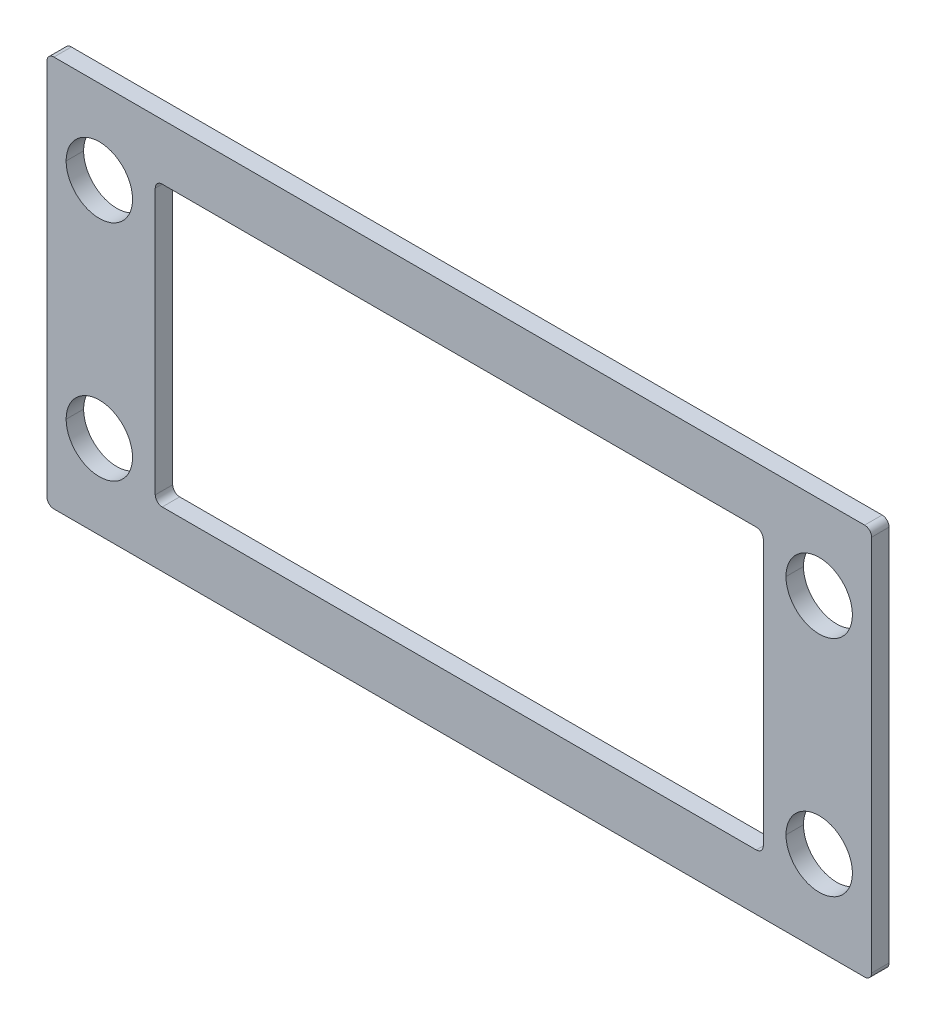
ISO-10303-21;
HEADER;
FILE_DESCRIPTION(('STEP AP214'),'2;1');
FILE_NAME('part.step','',(''),(''),'','','');
FILE_SCHEMA(('AUTOMOTIVE_DESIGN { 1 0 10303 214 1 1 1 1 }'));
ENDSEC;
DATA;
#1=APPLICATION_CONTEXT('core data for automotive mechanical design processes');
#2=APPLICATION_PROTOCOL_DEFINITION('international standard','automotive_design',2000,#1);
#3=PRODUCT_CONTEXT('',#1,'mechanical');
#4=PRODUCT('Part','Part','',(#3));
#5=PRODUCT_RELATED_PRODUCT_CATEGORY('part','',(#4));
#6=PRODUCT_DEFINITION_FORMATION('','',#4);
#7=PRODUCT_DEFINITION_CONTEXT('part definition',#1,'design');
#8=PRODUCT_DEFINITION('design','',#6,#7);
#9=PRODUCT_DEFINITION_SHAPE('','',#8);
#10=(LENGTH_UNIT() NAMED_UNIT(*) SI_UNIT(.MILLI.,.METRE.));
#11=(NAMED_UNIT(*) PLANE_ANGLE_UNIT() SI_UNIT($,.RADIAN.));
#12=(NAMED_UNIT(*) SI_UNIT($,.STERADIAN.) SOLID_ANGLE_UNIT());
#13=UNCERTAINTY_MEASURE_WITH_UNIT(LENGTH_MEASURE(1.E-05),#10,'distance_accuracy_value','');
#14=(GEOMETRIC_REPRESENTATION_CONTEXT(3) GLOBAL_UNCERTAINTY_ASSIGNED_CONTEXT((#13)) GLOBAL_UNIT_ASSIGNED_CONTEXT((#10,
#11,#12)) REPRESENTATION_CONTEXT('',''));
#15=CARTESIAN_POINT('',(0.,0.,0.));
#16=DIRECTION('',(0.,0.,1.));
#17=DIRECTION('',(1.,0.,0.));
#18=AXIS2_PLACEMENT_3D('',#15,#16,#17);
#19=CARTESIAN_POINT('',(51.5,-6.5,4.93502884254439));
#20=DIRECTION('',(0.,0.,-1.));
#21=DIRECTION('',(-1.,0.,0.));
#22=AXIS2_PLACEMENT_3D('',#19,#20,#21);
#23=CYLINDRICAL_SURFACE('',#22,4.75);
#24=DIRECTION('',(0.,0.,-1.));
#25=VECTOR('',#24,1.);
#26=CARTESIAN_POINT('',(56.25,-6.5,4.93502884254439));
#27=LINE('',#26,#25);
#28=CARTESIAN_POINT('',(56.25,-6.5,-8.5));
#29=VERTEX_POINT('',#28);
#30=CARTESIAN_POINT('',(56.25,-6.5,-11.));
#31=VERTEX_POINT('',#30);
#32=EDGE_CURVE('E452',#29,#31,#27,.T.);
#33=ORIENTED_EDGE('',*,*,#32,.F.);
#34=CARTESIAN_POINT('',(51.5,-6.5,-8.5));
#35=DIRECTION('',(0.,0.,-1.));
#36=DIRECTION('',(-1.,0.,0.));
#37=AXIS2_PLACEMENT_3D('',#34,#35,#36);
#38=CIRCLE('',#37,4.75);
#39=CARTESIAN_POINT('',(46.75,-6.5,-8.5));
#40=VERTEX_POINT('',#39);
#41=EDGE_CURVE('E274',#40,#29,#38,.T.);
#42=ORIENTED_EDGE('',*,*,#41,.F.);
#43=DIRECTION('',(0.,0.,-1.));
#44=VECTOR('',#43,1.);
#45=CARTESIAN_POINT('',(46.75,-6.5,4.93502884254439));
#46=LINE('',#45,#44);
#47=CARTESIAN_POINT('',(46.75,-6.5,-11.));
#48=VERTEX_POINT('',#47);
#49=EDGE_CURVE('E358',#40,#48,#46,.T.);
#50=ORIENTED_EDGE('',*,*,#49,.T.);
#51=CARTESIAN_POINT('',(51.5,-6.5,-11.));
#52=DIRECTION('',(0.,0.,1.));
#53=DIRECTION('',(1.,0.,0.));
#54=AXIS2_PLACEMENT_3D('',#51,#52,#53);
#55=CIRCLE('',#54,4.75);
#56=EDGE_CURVE('E223',#31,#48,#55,.T.);
#57=ORIENTED_EDGE('',*,*,#56,.F.);
#58=EDGE_LOOP('',(#33,#42,#50,#57));
#59=FACE_BOUND('',#58,.T.);
#60=ADVANCED_FACE('F15',(#59),#23,.F.);
#61=CARTESIAN_POINT('',(-51.5,-6.5,4.93502884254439));
#62=DIRECTION('',(0.,0.,-1.));
#63=DIRECTION('',(-1.,0.,0.));
#64=AXIS2_PLACEMENT_3D('',#61,#62,#63);
#65=CYLINDRICAL_SURFACE('',#64,4.75);
#66=DIRECTION('',(0.,0.,-1.));
#67=VECTOR('',#66,1.);
#68=CARTESIAN_POINT('',(-46.75,-6.5,4.93502884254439));
#69=LINE('',#68,#67);
#70=CARTESIAN_POINT('',(-46.75,-6.5,-8.5));
#71=VERTEX_POINT('',#70);
#72=CARTESIAN_POINT('',(-46.75,-6.5,-11.));
#73=VERTEX_POINT('',#72);
#74=EDGE_CURVE('E357',#71,#73,#69,.T.);
#75=ORIENTED_EDGE('',*,*,#74,.F.);
#76=CARTESIAN_POINT('',(-51.5,-6.5,-8.5));
#77=DIRECTION('',(0.,0.,-1.));
#78=DIRECTION('',(-1.,0.,0.));
#79=AXIS2_PLACEMENT_3D('',#76,#77,#78);
#80=CIRCLE('',#79,4.75);
#81=CARTESIAN_POINT('',(-56.25,-6.5,-8.5));
#82=VERTEX_POINT('',#81);
#83=EDGE_CURVE('E270',#82,#71,#80,.T.);
#84=ORIENTED_EDGE('',*,*,#83,.F.);
#85=DIRECTION('',(0.,0.,-1.));
#86=VECTOR('',#85,1.);
#87=CARTESIAN_POINT('',(-56.25,-6.5,4.93502884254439));
#88=LINE('',#87,#86);
#89=CARTESIAN_POINT('',(-56.25,-6.5,-11.));
#90=VERTEX_POINT('',#89);
#91=EDGE_CURVE('E366',#82,#90,#88,.T.);
#92=ORIENTED_EDGE('',*,*,#91,.T.);
#93=CARTESIAN_POINT('',(-51.5,-6.5,-11.));
#94=DIRECTION('',(0.,0.,1.));
#95=DIRECTION('',(1.,0.,0.));
#96=AXIS2_PLACEMENT_3D('',#93,#94,#95);
#97=CIRCLE('',#96,4.75);
#98=EDGE_CURVE('E311',#73,#90,#97,.T.);
#99=ORIENTED_EDGE('',*,*,#98,.F.);
#100=EDGE_LOOP('',(#75,#84,#92,#99));
#101=FACE_BOUND('',#100,.T.);
#102=ADVANCED_FACE('F440',(#101),#65,.F.);
#103=CARTESIAN_POINT('',(58.,4.5,-8.5));
#104=DIRECTION('',(0.,0.,-1.));
#105=DIRECTION('',(-1.,0.,0.));
#106=AXIS2_PLACEMENT_3D('',#103,#104,#105);
#107=CYLINDRICAL_SURFACE('',#106,1.);
#108=CARTESIAN_POINT('',(58.,4.5,-8.5));
#109=DIRECTION('',(0.,0.,1.));
#110=DIRECTION('',(-1.,0.,0.));
#111=AXIS2_PLACEMENT_3D('',#108,#109,#110);
#112=CIRCLE('',#111,1.);
#113=CARTESIAN_POINT('',(59.,4.5,-8.5));
#114=VERTEX_POINT('',#113);
#115=CARTESIAN_POINT('',(58.,5.5,-8.5));
#116=VERTEX_POINT('',#115);
#117=EDGE_CURVE('E219',#114,#116,#112,.T.);
#118=ORIENTED_EDGE('',*,*,#117,.F.);
#119=DIRECTION('',(0.,0.,1.));
#120=VECTOR('',#119,1.);
#121=CARTESIAN_POINT('',(59.,4.5,-8.5));
#122=LINE('',#121,#120);
#123=CARTESIAN_POINT('',(59.,4.5,-11.));
#124=VERTEX_POINT('',#123);
#125=EDGE_CURVE('E255',#124,#114,#122,.T.);
#126=ORIENTED_EDGE('',*,*,#125,.F.);
#127=CARTESIAN_POINT('',(58.,4.5,-11.));
#128=DIRECTION('',(0.,0.,-1.));
#129=DIRECTION('',(-1.,0.,0.));
#130=AXIS2_PLACEMENT_3D('',#127,#128,#129);
#131=CIRCLE('',#130,1.);
#132=CARTESIAN_POINT('',(58.,5.5,-11.));
#133=VERTEX_POINT('',#132);
#134=EDGE_CURVE('E294',#133,#124,#131,.T.);
#135=ORIENTED_EDGE('',*,*,#134,.F.);
#136=DIRECTION('',(0.,0.,-1.));
#137=VECTOR('',#136,1.);
#138=CARTESIAN_POINT('',(58.,5.5,-8.5));
#139=LINE('',#138,#137);
#140=EDGE_CURVE('E333',#116,#133,#139,.T.);
#141=ORIENTED_EDGE('',*,*,#140,.F.);
#142=EDGE_LOOP('',(#118,#126,#135,#141));
#143=FACE_BOUND('',#142,.T.);
#144=ADVANCED_FACE('F445',(#143),#107,.T.);
#145=CARTESIAN_POINT('',(58.,-49.5,-8.5));
#146=DIRECTION('',(0.,0.,-1.));
#147=DIRECTION('',(-1.,0.,0.));
#148=AXIS2_PLACEMENT_3D('',#145,#146,#147);
#149=CYLINDRICAL_SURFACE('',#148,1.);
#150=CARTESIAN_POINT('',(58.,-49.5,-8.5));
#151=DIRECTION('',(0.,0.,1.));
#152=DIRECTION('',(-1.,0.,0.));
#153=AXIS2_PLACEMENT_3D('',#150,#151,#152);
#154=CIRCLE('',#153,1.);
#155=CARTESIAN_POINT('',(58.,-50.5,-8.5));
#156=VERTEX_POINT('',#155);
#157=CARTESIAN_POINT('',(59.,-49.5,-8.5));
#158=VERTEX_POINT('',#157);
#159=EDGE_CURVE('E187',#156,#158,#154,.T.);
#160=ORIENTED_EDGE('',*,*,#159,.F.);
#161=DIRECTION('',(0.,0.,1.));
#162=VECTOR('',#161,1.);
#163=CARTESIAN_POINT('',(58.,-50.5,-8.5));
#164=LINE('',#163,#162);
#165=CARTESIAN_POINT('',(58.,-50.5,-11.));
#166=VERTEX_POINT('',#165);
#167=EDGE_CURVE('E172',#166,#156,#164,.T.);
#168=ORIENTED_EDGE('',*,*,#167,.F.);
#169=CARTESIAN_POINT('',(58.,-49.5,-11.));
#170=DIRECTION('',(0.,0.,-1.));
#171=DIRECTION('',(-1.,0.,0.));
#172=AXIS2_PLACEMENT_3D('',#169,#170,#171);
#173=CIRCLE('',#172,1.);
#174=CARTESIAN_POINT('',(59.,-49.5,-11.));
#175=VERTEX_POINT('',#174);
#176=EDGE_CURVE('E302',#175,#166,#173,.T.);
#177=ORIENTED_EDGE('',*,*,#176,.F.);
#178=DIRECTION('',(0.,0.,-1.));
#179=VECTOR('',#178,1.);
#180=CARTESIAN_POINT('',(59.,-49.5,-8.5));
#181=LINE('',#180,#179);
#182=EDGE_CURVE('E184',#158,#175,#181,.T.);
#183=ORIENTED_EDGE('',*,*,#182,.F.);
#184=EDGE_LOOP('',(#160,#168,#177,#183));
#185=FACE_BOUND('',#184,.T.);
#186=ADVANCED_FACE('F188',(#185),#149,.T.);
#187=CARTESIAN_POINT('',(-58.,-49.5,-8.5));
#188=DIRECTION('',(0.,0.,-1.));
#189=DIRECTION('',(-1.,0.,0.));
#190=AXIS2_PLACEMENT_3D('',#187,#188,#189);
#191=CYLINDRICAL_SURFACE('',#190,1.);
#192=CARTESIAN_POINT('',(-58.,-49.5,-8.5));
#193=DIRECTION('',(0.,0.,1.));
#194=DIRECTION('',(-1.,0.,0.));
#195=AXIS2_PLACEMENT_3D('',#192,#193,#194);
#196=CIRCLE('',#195,1.);
#197=CARTESIAN_POINT('',(-59.,-49.5,-8.5));
#198=VERTEX_POINT('',#197);
#199=CARTESIAN_POINT('',(-58.,-50.5,-8.5));
#200=VERTEX_POINT('',#199);
#201=EDGE_CURVE('E198',#198,#200,#196,.T.);
#202=ORIENTED_EDGE('',*,*,#201,.F.);
#203=DIRECTION('',(0.,0.,1.));
#204=VECTOR('',#203,1.);
#205=CARTESIAN_POINT('',(-59.,-49.5,-8.5));
#206=LINE('',#205,#204);
#207=CARTESIAN_POINT('',(-59.,-49.5,-11.));
#208=VERTEX_POINT('',#207);
#209=EDGE_CURVE('E238',#208,#198,#206,.T.);
#210=ORIENTED_EDGE('',*,*,#209,.F.);
#211=CARTESIAN_POINT('',(-58.,-49.5,-11.));
#212=DIRECTION('',(0.,0.,-1.));
#213=DIRECTION('',(-1.,0.,0.));
#214=AXIS2_PLACEMENT_3D('',#211,#212,#213);
#215=CIRCLE('',#214,1.);
#216=CARTESIAN_POINT('',(-58.,-50.5,-11.));
#217=VERTEX_POINT('',#216);
#218=EDGE_CURVE('E307',#217,#208,#215,.T.);
#219=ORIENTED_EDGE('',*,*,#218,.F.);
#220=DIRECTION('',(0.,0.,-1.));
#221=VECTOR('',#220,1.);
#222=CARTESIAN_POINT('',(-58.,-50.5,-8.5));
#223=LINE('',#222,#221);
#224=EDGE_CURVE('E166',#200,#217,#223,.T.);
#225=ORIENTED_EDGE('',*,*,#224,.F.);
#226=EDGE_LOOP('',(#202,#210,#219,#225));
#227=FACE_BOUND('',#226,.T.);
#228=ADVANCED_FACE('F615',(#227),#191,.T.);
#229=CARTESIAN_POINT('',(-58.,4.5,-8.5));
#230=DIRECTION('',(0.,0.,-1.));
#231=DIRECTION('',(-1.,0.,0.));
#232=AXIS2_PLACEMENT_3D('',#229,#230,#231);
#233=CYLINDRICAL_SURFACE('',#232,1.);
#234=CARTESIAN_POINT('',(-58.,4.5,-8.5));
#235=DIRECTION('',(0.,0.,1.));
#236=DIRECTION('',(-1.,0.,0.));
#237=AXIS2_PLACEMENT_3D('',#234,#235,#236);
#238=CIRCLE('',#237,1.);
#239=CARTESIAN_POINT('',(-58.,5.5,-8.5));
#240=VERTEX_POINT('',#239);
#241=CARTESIAN_POINT('',(-59.,4.5,-8.5));
#242=VERTEX_POINT('',#241);
#243=EDGE_CURVE('E395',#240,#242,#238,.T.);
#244=ORIENTED_EDGE('',*,*,#243,.F.);
#245=DIRECTION('',(0.,0.,1.));
#246=VECTOR('',#245,1.);
#247=CARTESIAN_POINT('',(-58.,5.5,-8.5));
#248=LINE('',#247,#246);
#249=CARTESIAN_POINT('',(-58.,5.5,-11.));
#250=VERTEX_POINT('',#249);
#251=EDGE_CURVE('E332',#250,#240,#248,.T.);
#252=ORIENTED_EDGE('',*,*,#251,.F.);
#253=CARTESIAN_POINT('',(-58.,4.5,-11.));
#254=DIRECTION('',(0.,0.,-1.));
#255=DIRECTION('',(-1.,0.,0.));
#256=AXIS2_PLACEMENT_3D('',#253,#254,#255);
#257=CIRCLE('',#256,1.);
#258=CARTESIAN_POINT('',(-59.,4.5,-11.));
#259=VERTEX_POINT('',#258);
#260=EDGE_CURVE('E286',#259,#250,#257,.T.);
#261=ORIENTED_EDGE('',*,*,#260,.F.);
#262=DIRECTION('',(0.,0.,-1.));
#263=VECTOR('',#262,1.);
#264=CARTESIAN_POINT('',(-59.,4.5,-8.5));
#265=LINE('',#264,#263);
#266=EDGE_CURVE('E231',#242,#259,#265,.T.);
#267=ORIENTED_EDGE('',*,*,#266,.F.);
#268=EDGE_LOOP('',(#244,#252,#261,#267));
#269=FACE_BOUND('',#268,.T.);
#270=ADVANCED_FACE('F612',(#269),#233,.T.);
#271=CARTESIAN_POINT('',(-42.5,-41.5,87.2548954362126));
#272=DIRECTION('',(0.,0.,1.));
#273=DIRECTION('',(1.,0.,0.));
#274=AXIS2_PLACEMENT_3D('',#271,#272,#273);
#275=CYLINDRICAL_SURFACE('',#274,1.);
#276=CARTESIAN_POINT('',(-42.5,-41.5,-8.5));
#277=DIRECTION('',(0.,0.,-1.));
#278=DIRECTION('',(-1.,0.,0.));
#279=AXIS2_PLACEMENT_3D('',#276,#277,#278);
#280=CIRCLE('',#279,1.);
#281=CARTESIAN_POINT('',(-42.5,-42.5,-8.5));
#282=VERTEX_POINT('',#281);
#283=CARTESIAN_POINT('',(-43.5,-41.5,-8.5));
#284=VERTEX_POINT('',#283);
#285=EDGE_CURVE('E264',#282,#284,#280,.T.);
#286=ORIENTED_EDGE('',*,*,#285,.F.);
#287=DIRECTION('',(0.,0.,1.));
#288=VECTOR('',#287,1.);
#289=CARTESIAN_POINT('',(-42.5,-42.5,-8.5));
#290=LINE('',#289,#288);
#291=CARTESIAN_POINT('',(-42.5,-42.5,-11.));
#292=VERTEX_POINT('',#291);
#293=EDGE_CURVE('E111',#292,#282,#290,.T.);
#294=ORIENTED_EDGE('',*,*,#293,.F.);
#295=CARTESIAN_POINT('',(-42.5,-41.5,-11.));
#296=DIRECTION('',(0.,0.,1.));
#297=DIRECTION('',(-1.,0.,0.));
#298=AXIS2_PLACEMENT_3D('',#295,#296,#297);
#299=CIRCLE('',#298,1.);
#300=CARTESIAN_POINT('',(-43.5,-41.5,-11.));
#301=VERTEX_POINT('',#300);
#302=EDGE_CURVE('E212',#301,#292,#299,.T.);
#303=ORIENTED_EDGE('',*,*,#302,.F.);
#304=DIRECTION('',(0.,0.,-1.));
#305=VECTOR('',#304,1.);
#306=CARTESIAN_POINT('',(-43.5,-41.5,-11.));
#307=LINE('',#306,#305);
#308=EDGE_CURVE('E10',#284,#301,#307,.T.);
#309=ORIENTED_EDGE('',*,*,#308,.F.);
#310=EDGE_LOOP('',(#286,#294,#303,#309));
#311=FACE_BOUND('',#310,.T.);
#312=ADVANCED_FACE('F574',(#311),#275,.F.);
#313=CARTESIAN_POINT('',(-42.5,-3.5,87.2548954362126));
#314=DIRECTION('',(0.,0.,1.));
#315=DIRECTION('',(1.,0.,0.));
#316=AXIS2_PLACEMENT_3D('',#313,#314,#315);
#317=CYLINDRICAL_SURFACE('',#316,1.);
#318=CARTESIAN_POINT('',(-42.5,-3.5,-8.5));
#319=DIRECTION('',(0.,0.,-1.));
#320=DIRECTION('',(-1.,0.,0.));
#321=AXIS2_PLACEMENT_3D('',#318,#319,#320);
#322=CIRCLE('',#321,1.);
#323=CARTESIAN_POINT('',(-43.5,-3.5,-8.5));
#324=VERTEX_POINT('',#323);
#325=CARTESIAN_POINT('',(-42.5,-2.5,-8.5));
#326=VERTEX_POINT('',#325);
#327=EDGE_CURVE('E235',#324,#326,#322,.T.);
#328=ORIENTED_EDGE('',*,*,#327,.F.);
#329=DIRECTION('',(0.,0.,1.));
#330=VECTOR('',#329,1.);
#331=CARTESIAN_POINT('',(-43.5,-3.5,-8.5));
#332=LINE('',#331,#330);
#333=CARTESIAN_POINT('',(-43.5,-3.5,-11.));
#334=VERTEX_POINT('',#333);
#335=EDGE_CURVE('E24',#334,#324,#332,.T.);
#336=ORIENTED_EDGE('',*,*,#335,.F.);
#337=CARTESIAN_POINT('',(-42.5,-3.5,-11.));
#338=DIRECTION('',(0.,0.,1.));
#339=DIRECTION('',(-1.,0.,0.));
#340=AXIS2_PLACEMENT_3D('',#337,#338,#339);
#341=CIRCLE('',#340,1.);
#342=CARTESIAN_POINT('',(-42.5,-2.5,-11.));
#343=VERTEX_POINT('',#342);
#344=EDGE_CURVE('E209',#343,#334,#341,.T.);
#345=ORIENTED_EDGE('',*,*,#344,.F.);
#346=DIRECTION('',(0.,0.,-1.));
#347=VECTOR('',#346,1.);
#348=CARTESIAN_POINT('',(-42.5,-2.5,-11.));
#349=LINE('',#348,#347);
#350=EDGE_CURVE('E278',#326,#343,#349,.T.);
#351=ORIENTED_EDGE('',*,*,#350,.F.);
#352=EDGE_LOOP('',(#328,#336,#345,#351));
#353=FACE_BOUND('',#352,.T.);
#354=ADVANCED_FACE('F420',(#353),#317,.F.);
#355=CARTESIAN_POINT('',(42.5,-3.5,87.2548954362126));
#356=DIRECTION('',(0.,0.,1.));
#357=DIRECTION('',(1.,0.,0.));
#358=AXIS2_PLACEMENT_3D('',#355,#356,#357);
#359=CYLINDRICAL_SURFACE('',#358,1.);
#360=CARTESIAN_POINT('',(42.5,-3.5,-8.5));
#361=DIRECTION('',(0.,0.,-1.));
#362=DIRECTION('',(-1.,0.,0.));
#363=AXIS2_PLACEMENT_3D('',#360,#361,#362);
#364=CIRCLE('',#363,1.);
#365=CARTESIAN_POINT('',(42.5,-2.5,-8.5));
#366=VERTEX_POINT('',#365);
#367=CARTESIAN_POINT('',(43.5,-3.5,-8.5));
#368=VERTEX_POINT('',#367);
#369=EDGE_CURVE('E246',#366,#368,#364,.T.);
#370=ORIENTED_EDGE('',*,*,#369,.F.);
#371=DIRECTION('',(0.,0.,1.));
#372=VECTOR('',#371,1.);
#373=CARTESIAN_POINT('',(42.5,-2.5,-8.5));
#374=LINE('',#373,#372);
#375=CARTESIAN_POINT('',(42.5,-2.5,-11.));
#376=VERTEX_POINT('',#375);
#377=EDGE_CURVE('E336',#376,#366,#374,.T.);
#378=ORIENTED_EDGE('',*,*,#377,.F.);
#379=CARTESIAN_POINT('',(42.5,-3.5,-11.));
#380=DIRECTION('',(0.,0.,1.));
#381=DIRECTION('',(-1.,0.,0.));
#382=AXIS2_PLACEMENT_3D('',#379,#380,#381);
#383=CIRCLE('',#382,1.);
#384=CARTESIAN_POINT('',(43.5,-3.5,-11.));
#385=VERTEX_POINT('',#384);
#386=EDGE_CURVE('E399',#385,#376,#383,.T.);
#387=ORIENTED_EDGE('',*,*,#386,.F.);
#388=DIRECTION('',(0.,0.,-1.));
#389=VECTOR('',#388,1.);
#390=CARTESIAN_POINT('',(43.5,-3.5,-11.));
#391=LINE('',#390,#389);
#392=EDGE_CURVE('E277',#368,#385,#391,.T.);
#393=ORIENTED_EDGE('',*,*,#392,.F.);
#394=EDGE_LOOP('',(#370,#378,#387,#393));
#395=FACE_BOUND('',#394,.T.);
#396=ADVANCED_FACE('F581',(#395),#359,.F.);
#397=CARTESIAN_POINT('',(42.5,-41.5,87.2548954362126));
#398=DIRECTION('',(0.,0.,1.));
#399=DIRECTION('',(1.,0.,0.));
#400=AXIS2_PLACEMENT_3D('',#397,#398,#399);
#401=CYLINDRICAL_SURFACE('',#400,1.);
#402=CARTESIAN_POINT('',(42.5,-41.5,-8.5));
#403=DIRECTION('',(0.,0.,-1.));
#404=DIRECTION('',(-1.,0.,0.));
#405=AXIS2_PLACEMENT_3D('',#402,#403,#404);
#406=CIRCLE('',#405,1.);
#407=CARTESIAN_POINT('',(43.5,-41.5,-8.5));
#408=VERTEX_POINT('',#407);
#409=CARTESIAN_POINT('',(42.5,-42.5,-8.5));
#410=VERTEX_POINT('',#409);
#411=EDGE_CURVE('E256',#408,#410,#406,.T.);
#412=ORIENTED_EDGE('',*,*,#411,.F.);
#413=DIRECTION('',(0.,0.,1.));
#414=VECTOR('',#413,1.);
#415=CARTESIAN_POINT('',(43.5,-41.5,-8.5));
#416=LINE('',#415,#414);
#417=CARTESIAN_POINT('',(43.5,-41.5,-11.));
#418=VERTEX_POINT('',#417);
#419=EDGE_CURVE('E132',#418,#408,#416,.T.);
#420=ORIENTED_EDGE('',*,*,#419,.F.);
#421=CARTESIAN_POINT('',(42.5,-41.5,-11.));
#422=DIRECTION('',(0.,0.,1.));
#423=DIRECTION('',(-1.,0.,0.));
#424=AXIS2_PLACEMENT_3D('',#421,#422,#423);
#425=CIRCLE('',#424,1.);
#426=CARTESIAN_POINT('',(42.5,-42.5,-11.));
#427=VERTEX_POINT('',#426);
#428=EDGE_CURVE('E323',#427,#418,#425,.T.);
#429=ORIENTED_EDGE('',*,*,#428,.F.);
#430=DIRECTION('',(0.,0.,-1.));
#431=VECTOR('',#430,1.);
#432=CARTESIAN_POINT('',(42.5,-42.5,-11.));
#433=LINE('',#432,#431);
#434=EDGE_CURVE('E120',#410,#427,#433,.T.);
#435=ORIENTED_EDGE('',*,*,#434,.F.);
#436=EDGE_LOOP('',(#412,#420,#429,#435));
#437=FACE_BOUND('',#436,.T.);
#438=ADVANCED_FACE('F576',(#437),#401,.F.);
#439=CARTESIAN_POINT('',(51.5,-38.5,87.2548954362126));
#440=DIRECTION('',(0.,0.,-1.));
#441=DIRECTION('',(-1.,0.,0.));
#442=AXIS2_PLACEMENT_3D('',#439,#440,#441);
#443=CYLINDRICAL_SURFACE('',#442,4.75);
#444=DIRECTION('',(0.,0.,-1.));
#445=VECTOR('',#444,1.);
#446=CARTESIAN_POINT('',(56.25,-38.5,87.2548954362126));
#447=LINE('',#446,#445);
#448=CARTESIAN_POINT('',(56.25,-38.5,-8.5));
#449=VERTEX_POINT('',#448);
#450=CARTESIAN_POINT('',(56.25,-38.5,-11.));
#451=VERTEX_POINT('',#450);
#452=EDGE_CURVE('E380',#449,#451,#447,.T.);
#453=ORIENTED_EDGE('',*,*,#452,.F.);
#454=CARTESIAN_POINT('',(51.5,-38.5,-8.5));
#455=DIRECTION('',(0.,0.,-1.));
#456=DIRECTION('',(-1.,0.,0.));
#457=AXIS2_PLACEMENT_3D('',#454,#455,#456);
#458=CIRCLE('',#457,4.75);
#459=CARTESIAN_POINT('',(46.75,-38.5,-8.5));
#460=VERTEX_POINT('',#459);
#461=EDGE_CURVE('E269',#460,#449,#458,.T.);
#462=ORIENTED_EDGE('',*,*,#461,.F.);
#463=DIRECTION('',(0.,0.,-1.));
#464=VECTOR('',#463,1.);
#465=CARTESIAN_POINT('',(46.75,-38.5,87.2548954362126));
#466=LINE('',#465,#464);
#467=CARTESIAN_POINT('',(46.75,-38.5,-11.));
#468=VERTEX_POINT('',#467);
#469=EDGE_CURVE('E352',#460,#468,#466,.T.);
#470=ORIENTED_EDGE('',*,*,#469,.T.);
#471=CARTESIAN_POINT('',(51.5,-38.5,-11.));
#472=DIRECTION('',(0.,0.,1.));
#473=DIRECTION('',(1.,0.,0.));
#474=AXIS2_PLACEMENT_3D('',#471,#472,#473);
#475=CIRCLE('',#474,4.75);
#476=EDGE_CURVE('E216',#451,#468,#475,.T.);
#477=ORIENTED_EDGE('',*,*,#476,.F.);
#478=EDGE_LOOP('',(#453,#462,#470,#477));
#479=FACE_BOUND('',#478,.T.);
#480=ADVANCED_FACE('F434',(#479),#443,.F.);
#481=CARTESIAN_POINT('',(-51.5,-38.5,87.2548954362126));
#482=DIRECTION('',(0.,0.,-1.));
#483=DIRECTION('',(-1.,0.,0.));
#484=AXIS2_PLACEMENT_3D('',#481,#482,#483);
#485=CYLINDRICAL_SURFACE('',#484,4.75);
#486=DIRECTION('',(0.,0.,-1.));
#487=VECTOR('',#486,1.);
#488=CARTESIAN_POINT('',(-46.75,-38.5,87.2548954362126));
#489=LINE('',#488,#487);
#490=CARTESIAN_POINT('',(-46.75,-38.5,-8.5));
#491=VERTEX_POINT('',#490);
#492=CARTESIAN_POINT('',(-46.75,-38.5,-11.));
#493=VERTEX_POINT('',#492);
#494=EDGE_CURVE('E371',#491,#493,#489,.T.);
#495=ORIENTED_EDGE('',*,*,#494,.F.);
#496=CARTESIAN_POINT('',(-51.5,-38.5,-8.5));
#497=DIRECTION('',(0.,0.,-1.));
#498=DIRECTION('',(-1.,0.,0.));
#499=AXIS2_PLACEMENT_3D('',#496,#497,#498);
#500=CIRCLE('',#499,4.75);
#501=CARTESIAN_POINT('',(-56.25,-38.5,-8.5));
#502=VERTEX_POINT('',#501);
#503=EDGE_CURVE('E265',#502,#491,#500,.T.);
#504=ORIENTED_EDGE('',*,*,#503,.F.);
#505=DIRECTION('',(0.,0.,-1.));
#506=VECTOR('',#505,1.);
#507=CARTESIAN_POINT('',(-56.25,-38.5,87.2548954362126));
#508=LINE('',#507,#506);
#509=CARTESIAN_POINT('',(-56.25,-38.5,-11.));
#510=VERTEX_POINT('',#509);
#511=EDGE_CURVE('E388',#502,#510,#508,.T.);
#512=ORIENTED_EDGE('',*,*,#511,.T.);
#513=CARTESIAN_POINT('',(-51.5,-38.5,-11.));
#514=DIRECTION('',(0.,0.,1.));
#515=DIRECTION('',(1.,0.,0.));
#516=AXIS2_PLACEMENT_3D('',#513,#514,#515);
#517=CIRCLE('',#516,4.75);
#518=EDGE_CURVE('E315',#493,#510,#517,.T.);
#519=ORIENTED_EDGE('',*,*,#518,.F.);
#520=EDGE_LOOP('',(#495,#504,#512,#519));
#521=FACE_BOUND('',#520,.T.);
#522=ADVANCED_FACE('F425',(#521),#485,.F.);
#523=CARTESIAN_POINT('',(-43.5,-42.5,87.2548954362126));
#524=DIRECTION('',(1.,0.,0.));
#525=DIRECTION('',(0.,1.,0.));
#526=AXIS2_PLACEMENT_3D('',#523,#524,#525);
#527=PLANE('',#526);
#528=DIRECTION('',(0.,-1.,0.));
#529=VECTOR('',#528,1.);
#530=CARTESIAN_POINT('',(-43.5,-42.5,-11.));
#531=LINE('',#530,#529);
#532=EDGE_CURVE('E210',#334,#301,#531,.T.);
#533=ORIENTED_EDGE('',*,*,#532,.F.);
#534=ORIENTED_EDGE('',*,*,#335,.T.);
#535=DIRECTION('',(0.,1.,0.));
#536=VECTOR('',#535,1.);
#537=CARTESIAN_POINT('',(-43.5,-42.5,-8.5));
#538=LINE('',#537,#536);
#539=EDGE_CURVE('E227',#284,#324,#538,.T.);
#540=ORIENTED_EDGE('',*,*,#539,.F.);
#541=ORIENTED_EDGE('',*,*,#308,.T.);
#542=EDGE_LOOP('',(#533,#534,#540,#541));
#543=FACE_BOUND('',#542,.T.);
#544=ADVANCED_FACE('F422',(#543),#527,.T.);
#545=CARTESIAN_POINT('',(-43.5,-42.5,87.2548954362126));
#546=DIRECTION('',(0.,1.,0.));
#547=DIRECTION('',(1.,0.,0.));
#548=AXIS2_PLACEMENT_3D('',#545,#546,#547);
#549=PLANE('',#548);
#550=DIRECTION('',(-1.,0.,0.));
#551=VECTOR('',#550,1.);
#552=CARTESIAN_POINT('',(-43.5,-42.5,-8.5));
#553=LINE('',#552,#551);
#554=EDGE_CURVE('E260',#410,#282,#553,.T.);
#555=ORIENTED_EDGE('',*,*,#554,.F.);
#556=ORIENTED_EDGE('',*,*,#434,.T.);
#557=DIRECTION('',(1.,0.,0.));
#558=VECTOR('',#557,1.);
#559=CARTESIAN_POINT('',(-43.5,-42.5,-11.));
#560=LINE('',#559,#558);
#561=EDGE_CURVE('E319',#292,#427,#560,.T.);
#562=ORIENTED_EDGE('',*,*,#561,.F.);
#563=ORIENTED_EDGE('',*,*,#293,.T.);
#564=EDGE_LOOP('',(#555,#556,#562,#563));
#565=FACE_BOUND('',#564,.T.);
#566=ADVANCED_FACE('F424',(#565),#549,.T.);
#567=CARTESIAN_POINT('',(43.5,-42.5,87.2548954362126));
#568=DIRECTION('',(-1.,0.,0.));
#569=DIRECTION('',(0.,0.,1.));
#570=AXIS2_PLACEMENT_3D('',#567,#568,#569);
#571=PLANE('',#570);
#572=DIRECTION('',(0.,1.,0.));
#573=VECTOR('',#572,1.);
#574=CARTESIAN_POINT('',(43.5,-42.5,-11.));
#575=LINE('',#574,#573);
#576=EDGE_CURVE('E327',#418,#385,#575,.T.);
#577=ORIENTED_EDGE('',*,*,#576,.F.);
#578=ORIENTED_EDGE('',*,*,#419,.T.);
#579=DIRECTION('',(0.,-1.,0.));
#580=VECTOR('',#579,1.);
#581=CARTESIAN_POINT('',(43.5,-42.5,-8.5));
#582=LINE('',#581,#580);
#583=EDGE_CURVE('E252',#368,#408,#582,.T.);
#584=ORIENTED_EDGE('',*,*,#583,.F.);
#585=ORIENTED_EDGE('',*,*,#392,.T.);
#586=EDGE_LOOP('',(#577,#578,#584,#585));
#587=FACE_BOUND('',#586,.T.);
#588=ADVANCED_FACE('F432',(#587),#571,.T.);
#589=CARTESIAN_POINT('',(-43.5,-2.5,87.2548954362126));
#590=DIRECTION('',(0.,-1.,0.));
#591=DIRECTION('',(0.,0.,-1.));
#592=AXIS2_PLACEMENT_3D('',#589,#590,#591);
#593=PLANE('',#592);
#594=DIRECTION('',(-1.,0.,0.));
#595=VECTOR('',#594,1.);
#596=CARTESIAN_POINT('',(-43.5,-2.5,-11.));
#597=LINE('',#596,#595);
#598=EDGE_CURVE('E406',#376,#343,#597,.T.);
#599=ORIENTED_EDGE('',*,*,#598,.F.);
#600=ORIENTED_EDGE('',*,*,#377,.T.);
#601=DIRECTION('',(1.,0.,0.));
#602=VECTOR('',#601,1.);
#603=CARTESIAN_POINT('',(-43.5,-2.5,-8.5));
#604=LINE('',#603,#602);
#605=EDGE_CURVE('E242',#326,#366,#604,.T.);
#606=ORIENTED_EDGE('',*,*,#605,.F.);
#607=ORIENTED_EDGE('',*,*,#350,.T.);
#608=EDGE_LOOP('',(#599,#600,#606,#607));
#609=FACE_BOUND('',#608,.T.);
#610=ADVANCED_FACE('F583',(#609),#593,.T.);
#611=CARTESIAN_POINT('',(-59.,5.5,-8.5));
#612=DIRECTION('',(0.,-1.,0.));
#613=DIRECTION('',(0.,0.,-1.));
#614=AXIS2_PLACEMENT_3D('',#611,#612,#613);
#615=PLANE('',#614);
#616=DIRECTION('',(-1.,0.,0.));
#617=VECTOR('',#616,1.);
#618=CARTESIAN_POINT('',(-59.,5.5,-11.));
#619=LINE('',#618,#617);
#620=EDGE_CURVE('E290',#133,#250,#619,.T.);
#621=ORIENTED_EDGE('',*,*,#620,.T.);
#622=ORIENTED_EDGE('',*,*,#251,.T.);
#623=DIRECTION('',(-1.,0.,0.));
#624=VECTOR('',#623,1.);
#625=CARTESIAN_POINT('',(-59.,5.5,-8.5));
#626=LINE('',#625,#624);
#627=EDGE_CURVE('E392',#116,#240,#626,.T.);
#628=ORIENTED_EDGE('',*,*,#627,.F.);
#629=ORIENTED_EDGE('',*,*,#140,.T.);
#630=EDGE_LOOP('',(#621,#622,#628,#629));
#631=FACE_BOUND('',#630,.T.);
#632=ADVANCED_FACE('F585',(#631),#615,.F.);
#633=CARTESIAN_POINT('',(59.,-50.5,-8.5));
#634=DIRECTION('',(-1.,0.,0.));
#635=DIRECTION('',(0.,0.,1.));
#636=AXIS2_PLACEMENT_3D('',#633,#634,#635);
#637=PLANE('',#636);
#638=DIRECTION('',(0.,1.,0.));
#639=VECTOR('',#638,1.);
#640=CARTESIAN_POINT('',(59.,-50.5,-8.5));
#641=LINE('',#640,#639);
#642=EDGE_CURVE('E193',#158,#114,#641,.T.);
#643=ORIENTED_EDGE('',*,*,#642,.F.);
#644=ORIENTED_EDGE('',*,*,#182,.T.);
#645=DIRECTION('',(0.,1.,0.));
#646=VECTOR('',#645,1.);
#647=CARTESIAN_POINT('',(59.,-50.5,-11.));
#648=LINE('',#647,#646);
#649=EDGE_CURVE('E298',#175,#124,#648,.T.);
#650=ORIENTED_EDGE('',*,*,#649,.T.);
#651=ORIENTED_EDGE('',*,*,#125,.T.);
#652=EDGE_LOOP('',(#643,#644,#650,#651));
#653=FACE_BOUND('',#652,.T.);
#654=ADVANCED_FACE('F591',(#653),#637,.F.);
#655=CARTESIAN_POINT('',(-59.,-50.5,-8.5));
#656=DIRECTION('',(0.,1.,0.));
#657=DIRECTION('',(1.,0.,0.));
#658=AXIS2_PLACEMENT_3D('',#655,#656,#657);
#659=PLANE('',#658);
#660=DIRECTION('',(1.,0.,0.));
#661=VECTOR('',#660,1.);
#662=CARTESIAN_POINT('',(-59.,-50.5,-8.5));
#663=LINE('',#662,#661);
#664=EDGE_CURVE('E176',#200,#156,#663,.T.);
#665=ORIENTED_EDGE('',*,*,#664,.F.);
#666=ORIENTED_EDGE('',*,*,#224,.T.);
#667=DIRECTION('',(1.,0.,0.));
#668=VECTOR('',#667,1.);
#669=CARTESIAN_POINT('',(-59.,-50.5,-11.));
#670=LINE('',#669,#668);
#671=EDGE_CURVE('E179',#217,#166,#670,.T.);
#672=ORIENTED_EDGE('',*,*,#671,.T.);
#673=ORIENTED_EDGE('',*,*,#167,.T.);
#674=EDGE_LOOP('',(#665,#666,#672,#673));
#675=FACE_BOUND('',#674,.T.);
#676=ADVANCED_FACE('F174',(#675),#659,.F.);
#677=CARTESIAN_POINT('',(-59.,-50.5,-8.5));
#678=DIRECTION('',(1.,0.,0.));
#679=DIRECTION('',(0.,1.,0.));
#680=AXIS2_PLACEMENT_3D('',#677,#678,#679);
#681=PLANE('',#680);
#682=DIRECTION('',(0.,-1.,0.));
#683=VECTOR('',#682,1.);
#684=CARTESIAN_POINT('',(-59.,-50.5,-8.5));
#685=LINE('',#684,#683);
#686=EDGE_CURVE('E205',#242,#198,#685,.T.);
#687=ORIENTED_EDGE('',*,*,#686,.F.);
#688=ORIENTED_EDGE('',*,*,#266,.T.);
#689=DIRECTION('',(0.,-1.,0.));
#690=VECTOR('',#689,1.);
#691=CARTESIAN_POINT('',(-59.,-50.5,-11.));
#692=LINE('',#691,#690);
#693=EDGE_CURVE('E282',#259,#208,#692,.T.);
#694=ORIENTED_EDGE('',*,*,#693,.T.);
#695=ORIENTED_EDGE('',*,*,#209,.T.);
#696=EDGE_LOOP('',(#687,#688,#694,#695));
#697=FACE_BOUND('',#696,.T.);
#698=ADVANCED_FACE('F598',(#697),#681,.F.);
#699=CARTESIAN_POINT('',(-59.,5.5,-11.));
#700=DIRECTION('',(0.,0.,-1.));
#701=DIRECTION('',(0.,-1.,0.));
#702=AXIS2_PLACEMENT_3D('',#699,#700,#701);
#703=PLANE('',#702);
#704=CARTESIAN_POINT('',(51.5,-6.5,-11.));
#705=DIRECTION('',(0.,0.,1.));
#706=DIRECTION('',(1.,0.,0.));
#707=AXIS2_PLACEMENT_3D('',#704,#705,#706);
#708=CIRCLE('',#707,4.75);
#709=EDGE_CURVE('E464',#48,#31,#708,.T.);
#710=ORIENTED_EDGE('',*,*,#709,.T.);
#711=ORIENTED_EDGE('',*,*,#56,.T.);
#712=EDGE_LOOP('',(#710,#711));
#713=FACE_BOUND('',#712,.T.);
#714=CARTESIAN_POINT('',(51.5,-38.5,-11.));
#715=DIRECTION('',(0.,0.,1.));
#716=DIRECTION('',(1.,0.,0.));
#717=AXIS2_PLACEMENT_3D('',#714,#715,#716);
#718=CIRCLE('',#717,4.75);
#719=EDGE_CURVE('E381',#468,#451,#718,.T.);
#720=ORIENTED_EDGE('',*,*,#719,.T.);
#721=ORIENTED_EDGE('',*,*,#476,.T.);
#722=EDGE_LOOP('',(#720,#721));
#723=FACE_BOUND('',#722,.T.);
#724=ORIENTED_EDGE('',*,*,#561,.T.);
#725=ORIENTED_EDGE('',*,*,#428,.T.);
#726=ORIENTED_EDGE('',*,*,#576,.T.);
#727=ORIENTED_EDGE('',*,*,#386,.T.);
#728=ORIENTED_EDGE('',*,*,#598,.T.);
#729=ORIENTED_EDGE('',*,*,#344,.T.);
#730=ORIENTED_EDGE('',*,*,#532,.T.);
#731=ORIENTED_EDGE('',*,*,#302,.T.);
#732=EDGE_LOOP('',(#724,#725,#726,#727,#728,#729,#730,#731));
#733=FACE_BOUND('',#732,.T.);
#734=CARTESIAN_POINT('',(-51.5,-38.5,-11.));
#735=DIRECTION('',(0.,0.,1.));
#736=DIRECTION('',(1.,0.,0.));
#737=AXIS2_PLACEMENT_3D('',#734,#735,#736);
#738=CIRCLE('',#737,4.75);
#739=EDGE_CURVE('E375',#510,#493,#738,.T.);
#740=ORIENTED_EDGE('',*,*,#739,.T.);
#741=ORIENTED_EDGE('',*,*,#518,.T.);
#742=EDGE_LOOP('',(#740,#741));
#743=FACE_BOUND('',#742,.T.);
#744=CARTESIAN_POINT('',(-51.5,-6.5,-11.));
#745=DIRECTION('',(0.,0.,1.));
#746=DIRECTION('',(1.,0.,0.));
#747=AXIS2_PLACEMENT_3D('',#744,#745,#746);
#748=CIRCLE('',#747,4.75);
#749=EDGE_CURVE('E362',#90,#73,#748,.T.);
#750=ORIENTED_EDGE('',*,*,#749,.T.);
#751=ORIENTED_EDGE('',*,*,#98,.T.);
#752=EDGE_LOOP('',(#750,#751));
#753=FACE_BOUND('',#752,.T.);
#754=ORIENTED_EDGE('',*,*,#693,.F.);
#755=ORIENTED_EDGE('',*,*,#260,.T.);
#756=ORIENTED_EDGE('',*,*,#620,.F.);
#757=ORIENTED_EDGE('',*,*,#134,.T.);
#758=ORIENTED_EDGE('',*,*,#649,.F.);
#759=ORIENTED_EDGE('',*,*,#176,.T.);
#760=ORIENTED_EDGE('',*,*,#671,.F.);
#761=ORIENTED_EDGE('',*,*,#218,.T.);
#762=EDGE_LOOP('',(#754,#755,#756,#757,#758,#759,#760,#761));
#763=FACE_BOUND('',#762,.T.);
#764=ADVANCED_FACE('F417',(#713,#723,#733,#743,#753,#763),#703,.T.);
#765=CARTESIAN_POINT('',(-59.,5.5,-8.5));
#766=DIRECTION('',(0.,0.,-1.));
#767=DIRECTION('',(0.,-1.,0.));
#768=AXIS2_PLACEMENT_3D('',#765,#766,#767);
#769=PLANE('',#768);
#770=ORIENTED_EDGE('',*,*,#41,.T.);
#771=CARTESIAN_POINT('',(51.5,-6.5,-8.5));
#772=DIRECTION('',(0.,0.,-1.));
#773=DIRECTION('',(-1.,0.,0.));
#774=AXIS2_PLACEMENT_3D('',#771,#772,#773);
#775=CIRCLE('',#774,4.75);
#776=EDGE_CURVE('E465',#29,#40,#775,.T.);
#777=ORIENTED_EDGE('',*,*,#776,.T.);
#778=EDGE_LOOP('',(#770,#777));
#779=FACE_BOUND('',#778,.T.);
#780=ORIENTED_EDGE('',*,*,#83,.T.);
#781=CARTESIAN_POINT('',(-51.5,-6.5,-8.5));
#782=DIRECTION('',(0.,0.,-1.));
#783=DIRECTION('',(-1.,0.,0.));
#784=AXIS2_PLACEMENT_3D('',#781,#782,#783);
#785=CIRCLE('',#784,4.75);
#786=EDGE_CURVE('E354',#71,#82,#785,.T.);
#787=ORIENTED_EDGE('',*,*,#786,.T.);
#788=EDGE_LOOP('',(#780,#787));
#789=FACE_BOUND('',#788,.T.);
#790=ORIENTED_EDGE('',*,*,#461,.T.);
#791=CARTESIAN_POINT('',(51.5,-38.5,-8.5));
#792=DIRECTION('',(0.,0.,-1.));
#793=DIRECTION('',(-1.,0.,0.));
#794=AXIS2_PLACEMENT_3D('',#791,#792,#793);
#795=CIRCLE('',#794,4.75);
#796=EDGE_CURVE('E370',#449,#460,#795,.T.);
#797=ORIENTED_EDGE('',*,*,#796,.T.);
#798=EDGE_LOOP('',(#790,#797));
#799=FACE_BOUND('',#798,.T.);
#800=ORIENTED_EDGE('',*,*,#503,.T.);
#801=CARTESIAN_POINT('',(-51.5,-38.5,-8.5));
#802=DIRECTION('',(0.,0.,-1.));
#803=DIRECTION('',(-1.,0.,0.));
#804=AXIS2_PLACEMENT_3D('',#801,#802,#803);
#805=CIRCLE('',#804,4.75);
#806=EDGE_CURVE('E376',#491,#502,#805,.T.);
#807=ORIENTED_EDGE('',*,*,#806,.T.);
#808=EDGE_LOOP('',(#800,#807));
#809=FACE_BOUND('',#808,.T.);
#810=ORIENTED_EDGE('',*,*,#539,.T.);
#811=ORIENTED_EDGE('',*,*,#327,.T.);
#812=ORIENTED_EDGE('',*,*,#605,.T.);
#813=ORIENTED_EDGE('',*,*,#369,.T.);
#814=ORIENTED_EDGE('',*,*,#583,.T.);
#815=ORIENTED_EDGE('',*,*,#411,.T.);
#816=ORIENTED_EDGE('',*,*,#554,.T.);
#817=ORIENTED_EDGE('',*,*,#285,.T.);
#818=EDGE_LOOP('',(#810,#811,#812,#813,#814,#815,#816,#817));
#819=FACE_BOUND('',#818,.T.);
#820=ORIENTED_EDGE('',*,*,#627,.T.);
#821=ORIENTED_EDGE('',*,*,#243,.T.);
#822=ORIENTED_EDGE('',*,*,#686,.T.);
#823=ORIENTED_EDGE('',*,*,#201,.T.);
#824=ORIENTED_EDGE('',*,*,#664,.T.);
#825=ORIENTED_EDGE('',*,*,#159,.T.);
#826=ORIENTED_EDGE('',*,*,#642,.T.);
#827=ORIENTED_EDGE('',*,*,#117,.T.);
#828=EDGE_LOOP('',(#820,#821,#822,#823,#824,#825,#826,#827));
#829=FACE_BOUND('',#828,.T.);
#830=ADVANCED_FACE('F196',(#779,#789,#799,#809,#819,#829),#769,.F.);
#831=CARTESIAN_POINT('',(-51.5,-38.5,87.2548954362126));
#832=DIRECTION('',(0.,0.,-1.));
#833=DIRECTION('',(-1.,0.,0.));
#834=AXIS2_PLACEMENT_3D('',#831,#832,#833);
#835=CYLINDRICAL_SURFACE('',#834,4.75);
#836=ORIENTED_EDGE('',*,*,#806,.F.);
#837=ORIENTED_EDGE('',*,*,#494,.T.);
#838=ORIENTED_EDGE('',*,*,#739,.F.);
#839=ORIENTED_EDGE('',*,*,#511,.F.);
#840=EDGE_LOOP('',(#836,#837,#838,#839));
#841=FACE_BOUND('',#840,.T.);
#842=ADVANCED_FACE('F571',(#841),#835,.F.);
#843=CARTESIAN_POINT('',(51.5,-38.5,87.2548954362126));
#844=DIRECTION('',(0.,0.,-1.));
#845=DIRECTION('',(-1.,0.,0.));
#846=AXIS2_PLACEMENT_3D('',#843,#844,#845);
#847=CYLINDRICAL_SURFACE('',#846,4.75);
#848=ORIENTED_EDGE('',*,*,#796,.F.);
#849=ORIENTED_EDGE('',*,*,#452,.T.);
#850=ORIENTED_EDGE('',*,*,#719,.F.);
#851=ORIENTED_EDGE('',*,*,#469,.F.);
#852=EDGE_LOOP('',(#848,#849,#850,#851));
#853=FACE_BOUND('',#852,.T.);
#854=ADVANCED_FACE('F568',(#853),#847,.F.);
#855=CARTESIAN_POINT('',(-51.5,-6.5,4.93502884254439));
#856=DIRECTION('',(0.,0.,-1.));
#857=DIRECTION('',(-1.,0.,0.));
#858=AXIS2_PLACEMENT_3D('',#855,#856,#857);
#859=CYLINDRICAL_SURFACE('',#858,4.75);
#860=ORIENTED_EDGE('',*,*,#786,.F.);
#861=ORIENTED_EDGE('',*,*,#74,.T.);
#862=ORIENTED_EDGE('',*,*,#749,.F.);
#863=ORIENTED_EDGE('',*,*,#91,.F.);
#864=EDGE_LOOP('',(#860,#861,#862,#863));
#865=FACE_BOUND('',#864,.T.);
#866=ADVANCED_FACE('F641',(#865),#859,.F.);
#867=CARTESIAN_POINT('',(51.5,-6.5,4.93502884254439));
#868=DIRECTION('',(0.,0.,-1.));
#869=DIRECTION('',(-1.,0.,0.));
#870=AXIS2_PLACEMENT_3D('',#867,#868,#869);
#871=CYLINDRICAL_SURFACE('',#870,4.75);
#872=ORIENTED_EDGE('',*,*,#776,.F.);
#873=ORIENTED_EDGE('',*,*,#32,.T.);
#874=ORIENTED_EDGE('',*,*,#709,.F.);
#875=ORIENTED_EDGE('',*,*,#49,.F.);
#876=EDGE_LOOP('',(#872,#873,#874,#875));
#877=FACE_BOUND('',#876,.T.);
#878=ADVANCED_FACE('F468',(#877),#871,.F.);
#879=CLOSED_SHELL('',(#60,#102,#144,#186,#228,#270,#312,#354,#396,#438,#480,#522,#544,#566,#588,
#610,#632,#654,#676,#698,#764,#830,#842,#854,#866,#878));
#880=MANIFOLD_SOLID_BREP('B1',#879);
#881=ADVANCED_BREP_SHAPE_REPRESENTATION('',(#18,#880),#14);
#882=SHAPE_DEFINITION_REPRESENTATION(#9,#881);
ENDSEC;
END-ISO-10303-21;
